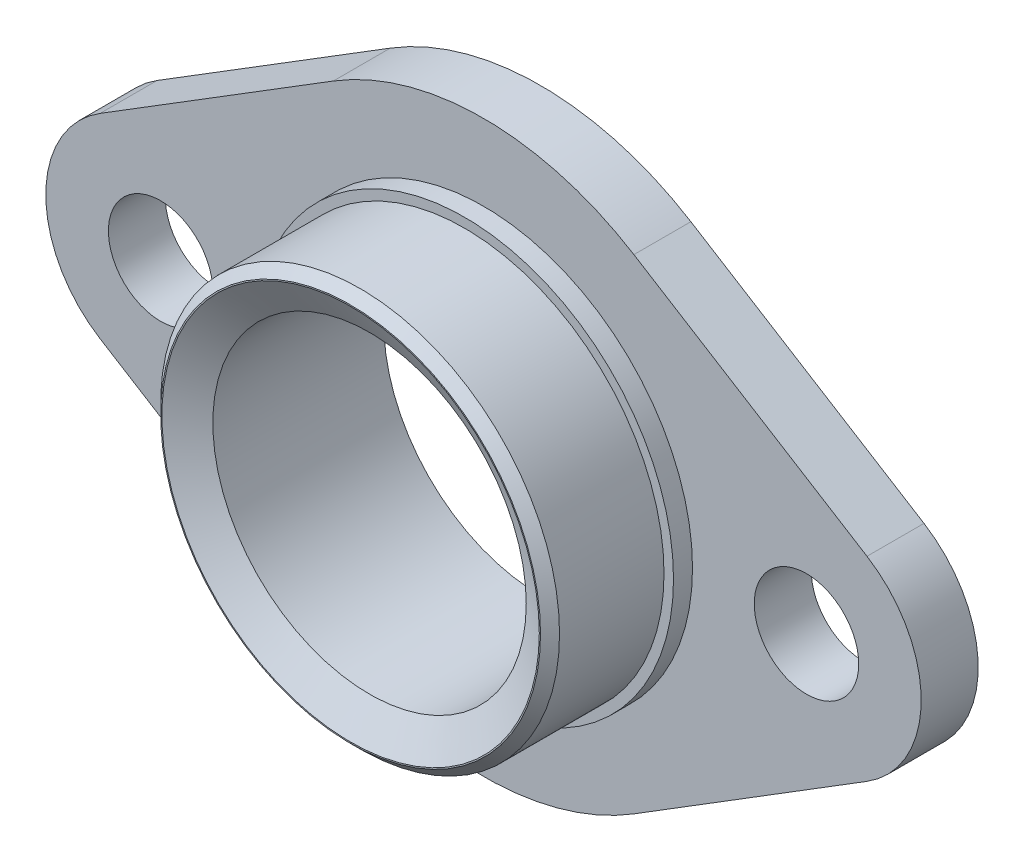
from build123d import *

# Parameters (mm, degrees)
SKETCH_1_R          = 5.5
SKETCH_1_R_2        = 16.5
EXTRUDE_1_DEPTH     = 6
SKETCH_2_R          = 22
EXTRUDE_2_DEPTH     = 2
SKETCH_3_R          = 21
EXTRUDE_3_DEPTH     = 12
SKETCH_4_R          = 16.5
CUT_EXTRUDE_1_DEPTH = 57.754105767
CHAMFER_2_SIZE      = 1


with BuildPart() as part:
    # Sketch 1 → Extrude 1 (new body)
    with BuildSketch(Plane.XY):
        with BuildLine():
            Line((-15.817613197, 25.504143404), (-40.372638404, 10.275171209))
            ThreePointArc((-40.372638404, 10.275171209), (-46.090891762, 0), (-40.372638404, -10.275171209))
            Line((-40.372638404, -10.275171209), (-15.817613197, -25.504143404))
            ThreePointArc((-15.817613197, -25.504143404), (0.006172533, -30.01096766), (15.828103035, -25.497634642))
            Line((15.828103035, -25.497634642), (40.370596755, -10.262452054))
            ThreePointArc((40.370596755, -10.262452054), (46.079007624, 0), (40.370596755, 10.262452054))
            Line((40.370596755, 10.262452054), (15.828103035, 25.497634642))
            ThreePointArc((15.828103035, 25.497634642), (0.006172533, 30.01096766), (-15.817613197, 25.504143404))
        make_face()
        with Locations((-34, 0)):
            Circle(SKETCH_1_R, mode=Mode.SUBTRACT)
        with Locations((34, 0)):
            Circle(SKETCH_1_R, mode=Mode.SUBTRACT)
        Circle(SKETCH_1_R_2, mode=Mode.SUBTRACT)
    extrude(amount=EXTRUDE_1_DEPTH)

    # Sketch 2 → Extrude 2 (add)
    with BuildSketch(Plane.XY.offset(6)):
        Circle(SKETCH_2_R)
    extrude(amount=EXTRUDE_2_DEPTH)

    # Sketch 3 → Extrude 3 (add)
    with BuildSketch(Plane.XY.offset(8)):
        Circle(SKETCH_3_R)
    extrude(amount=EXTRUDE_3_DEPTH)

    # Sketch 4 → Cut-Extrude 1 (cut, through all)
    with BuildSketch(Plane(origin=(0, 0, 6), x_dir=(-1, 0, 0), z_dir=(0, 0, -1))):
        with Locations(Location((0, 0, 0), (0, 0, 180))):
            Circle(SKETCH_4_R)
    extrude(amount=-CUT_EXTRUDE_1_DEPTH, mode=Mode.SUBTRACT)

    # Chamfer 2
    chamfer_2_edges = [part.edges().sort_by_distance(p)[0] for p in [
        (-21, 0, 20),
    ]]
    chamfer(chamfer_2_edges, length=CHAMFER_2_SIZE)

    # Sketch 6 → Cut-Revolve 8 (revolve, cut)
    with BuildSketch(Plane(origin=(0, 0, 0), x_dir=(0, 0, -1), z_dir=(1, 0, 0)), mode=Mode.PRIVATE) as cut_revolve_8_sk:
        Polygon((-20.670566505, 21), (-20.670566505, 0), (-18.004799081, 0), (-18.004799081, 16.5), align=None)
    revolve(cut_revolve_8_sk.sketch.rotate(Axis((0, 0, 30.206097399), (0, 0, -1)), 90), axis=Axis((0, 0, 30.206097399), (0, 0, -1)), mode=Mode.SUBTRACT)


solid = part.part
